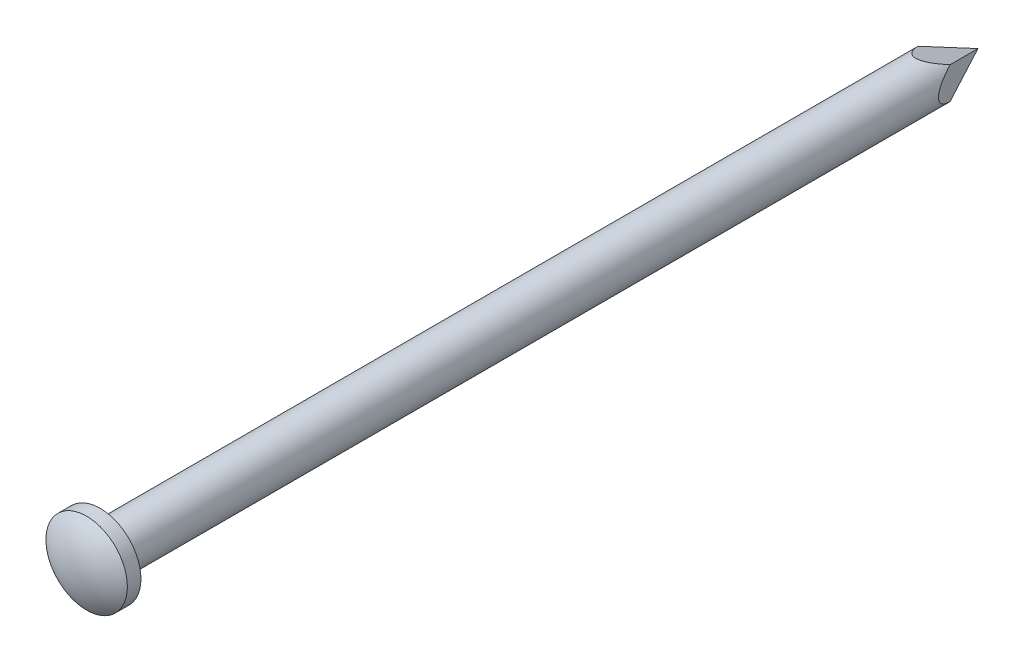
from build123d import *

# Parameters (mm, degrees)
ESQUISSE1_R                  = 1.25
BASE_EXTRUSION_DEPTH         = 48.5
ESQUISSE2_R                  = 2.25
BOSS_EXTRU_1_DEPTH           = 0.75
D_ME1_FACE_RADIUS            = 2.25
D_ME1_HEIGHT                 = 0.75
ENL_V_MAT_EXTRU_1_DEPTH      = 2.5
R_P_TITION_CIRCULAIRE1_COUNT = 2
ENL_V_MAT_EXTRU_2_DEPTH      = 2.5
R_P_TITION_CIRCULAIRE2_COUNT = 2


with BuildPart() as part:
    # Esquisse1 → Base-Extrusion (new body)
    with BuildSketch(Plane.XY):
        Circle(ESQUISSE1_R)
    extrude(amount=-BASE_EXTRUSION_DEPTH)

    # Esquisse2 → Boss.-Extru.1 (add)
    with BuildSketch(Plane.XY):
        Circle(ESQUISSE2_R)
    extrude(amount=BOSS_EXTRU_1_DEPTH)

    # D_me1: a dome of height H over a round flat face of radius A is a cap of a sphere of radius (A * A + H * H) / (2 * H)
    d_me1_r = (D_ME1_FACE_RADIUS * D_ME1_FACE_RADIUS + D_ME1_HEIGHT * D_ME1_HEIGHT) / (2 * D_ME1_HEIGHT)
    d_me1_base = Plane((0, 0, 0.75), z_dir=(0, 0, 1))
    with Locations(d_me1_base.offset(D_ME1_HEIGHT - d_me1_r)):
        d_me1_ball = Sphere(d_me1_r, mode=Mode.PRIVATE)
    add(split(d_me1_ball, bisect_by=d_me1_base, keep=Keep.TOP, mode=Mode.PRIVATE))

    # Esquisse3 → Enl_v. mat.-Extru.1 (cut, symmetric)
    with BuildSketch(Plane(origin=(0, 0, 0), x_dir=(0, 0, -1), z_dir=(1, 0, 0))):
        Polygon((48.5, 0), (48.5, 1.25), (45.065653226, 1.25), align=None)
    enl_v_mat_extru_1 = extrude(amount=ENL_V_MAT_EXTRU_1_DEPTH, both=True, mode=Mode.SUBTRACT)

    # R_p_tition circulaire1: Enl_v. mat.-Extru.1 ×2 about axis
    r_p_tition_circulaire1_axis = Axis((0, 0, -98.5), (0, 0, 1))
    for i in range(1, R_P_TITION_CIRCULAIRE1_COUNT):
        add(enl_v_mat_extru_1.rotate(r_p_tition_circulaire1_axis, i * 360 / R_P_TITION_CIRCULAIRE1_COUNT), mode=Mode.SUBTRACT)

    # Esquisse4 → Enl_v. mat.-Extru.2 (cut, symmetric)
    with BuildSketch(Plane(origin=(0, 0, 0), x_dir=(1, 0, 0), z_dir=(0, 1, 0))):
        Polygon((0, 48.5), (-1.25, 48.5), (-1.25, 45.065653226), align=None)
    enl_v_mat_extru_2 = extrude(amount=ENL_V_MAT_EXTRU_2_DEPTH, both=True, mode=Mode.SUBTRACT)

    # R_p_tition circulaire2: Enl_v. mat.-Extru.2 ×2 about axis
    r_p_tition_circulaire2_axis = Axis((0, 0, -98.5), (0, 0, 1))
    for i in range(1, R_P_TITION_CIRCULAIRE2_COUNT):
        add(enl_v_mat_extru_2.rotate(r_p_tition_circulaire2_axis, i * 360 / R_P_TITION_CIRCULAIRE2_COUNT), mode=Mode.SUBTRACT)


solid = part.part
